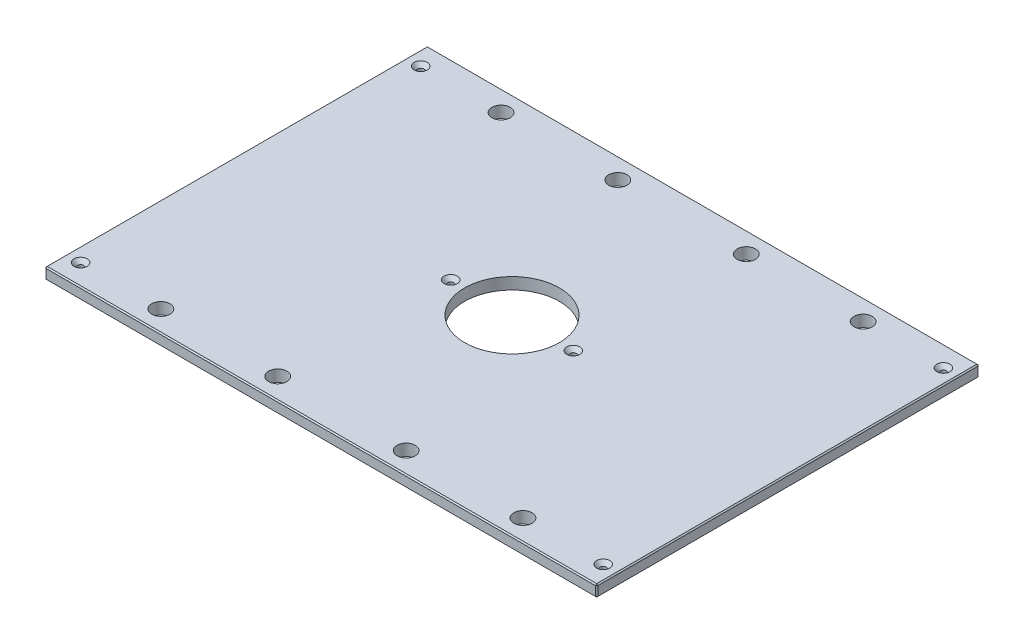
from build123d import *

# Parameters (mm, degrees)
SKETCH1_W                                        = 600.075
SKETCH1_H                                        = 415.925
BOSS_EXTRUDE1_DEPTH                              = 12.7
SKETCH13_R                                       = 51.562
CUT_EXTRUDE6_DEPTH                               = 366.283715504
F_25_32_0_78125_DIAMETER_HOLE1_D                 = 19.84375
CHAMFER2_SIZE                                    = 1.27
CSK_FOR_1_4_FLAT_HEAD_MACHINE_SCREW1_D           = 6.7564
CSK_FOR_1_4_FLAT_HEAD_MACHINE_SCREW1_CSINK_D     = 14.2748
CSK_FOR_1_4_FLAT_HEAD_MACHINE_SCREW1_CSINK_ANGLE = 82


with BuildPart() as part:
    # Sketch1 → Boss-Extrude1 (new body)
    with BuildSketch(Plane(origin=(0, 0, 0), x_dir=(1, 0, 0), z_dir=(0, 1, 0))):
        Rectangle(SKETCH1_W, SKETCH1_H)
    extrude(amount=BOSS_EXTRUDE1_DEPTH)

    # Sketch13 → Cut-Extrude6 (cut, through all)
    with BuildSketch(Plane(origin=(0, 12.7, 0), x_dir=(1, 0, 0), z_dir=(0, 1, 0))):
        with Locations(Location((0, 0, 0), (0, 0, 270))):
            Circle(SKETCH13_R)
    extrude(amount=-CUT_EXTRUDE6_DEPTH, mode=Mode.SUBTRACT)

    # 25_32 _0.78125_ Diameter Hole1 (through all)
    with Locations(Plane(origin=(0, 12.7, 0), x_dir=(1, 0, 0), z_dir=(0, 1, 0))):
        with Locations((196.85, 184.94248), (-196.85, 184.94248), (196.85, -184.94248), (-196.85, -184.94248), (-69.85, 184.94248), (69.85, 184.94248), (69.85, -184.94248), (-69.85, -184.94248)):
            Hole(F_25_32_0_78125_DIAMETER_HOLE1_D / 2)

    # Chamfer2
    chamfer2_edges = [part.edges().sort_by_distance(p)[0] for p in [
        (300.0375, 12.7, 0),
        (0, 12.7, -207.9625),
        (-300.0375, 12.7, 0),
        (0, 0, -207.9625),
        (300.0375, 0, 0),
        (0, 0, 207.9625),
        (-300.0375, 0, 0),
        (0, 12.7, 207.9625),
        (-300.0375, 6.35, -207.9625),
        (300.0375, 6.35, -207.9625),
        (300.0375, 6.35, 207.9625),
        (-300.0375, 6.35, 207.9625),
    ]]
    chamfer(chamfer2_edges, length=CHAMFER2_SIZE)

    # CSK for 1_4 Flat Head Machine Screw1 (through all)
    with Locations(Plane(origin=(0, 12.7, 0), x_dir=(1, 0, 0), z_dir=(0, 1, 0))):
        with Locations((284.1625, 184.94248), (284.1625, -184.94248), (-284.1625, -184.94248), (-66.675, 0), (66.675, 0), (-284.1625, 184.94248), (-196.85, 184.94248), (-196.85, -184.94248)):
            CounterSinkHole(CSK_FOR_1_4_FLAT_HEAD_MACHINE_SCREW1_D / 2, CSK_FOR_1_4_FLAT_HEAD_MACHINE_SCREW1_CSINK_D / 2, counter_sink_angle=CSK_FOR_1_4_FLAT_HEAD_MACHINE_SCREW1_CSINK_ANGLE)


solid = part.part
